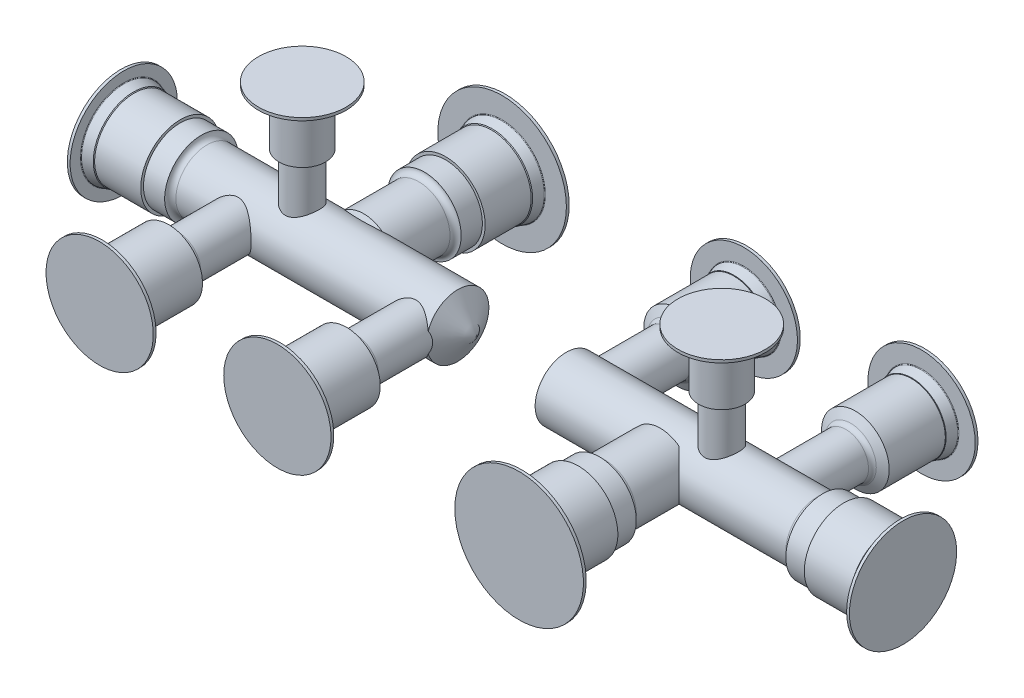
from build123d import *

# Parameters (mm, degrees)
LPATTERN1_COUNT       = 2
LPATTERN1_PITCH       = 50
BODY_MOVE_COPY1_ANGLE = 180
LPATTERN2_COUNT       = 2
LPATTERN2_PITCH       = 118


with BuildPart() as part:
    # Sketch1 → Revolve1 (revolve)
    with BuildSketch(Plane(origin=(0, 0, 0), x_dir=(1, 0, 0), z_dir=(0, 1, 0)), mode=Mode.PRIVATE) as revolve1_sk:
        with BuildLine():
            Line((100, 0), (94.734658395, -8.763))
            Line((94.734658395, -8.763), (24.2062, -8.763))
            ThreePointArc((24.2062, -8.763), (23.092648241, -9.224248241), (22.6314, -10.3378))
            Line((22.6314, -10.3378), (16.6624, -10.3378))
            Line((16.6624, -10.3378), (16.6624, -11.1125))
            Line((16.6624, -11.1125), (3.713097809, -11.1125))
            Line((3.713097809, -11.1125), (3.5179, -11.307697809))
            Line((3.5179, -11.307697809), (0.928594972, -12.0015))
            ThreePointArc((0.928594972, -12.0015), (0.826766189, -12.069539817), (0.7874, -12.185508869))
            Line((0.7874, -12.185508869), (0.7874, -15.0876))
            Line((0.7874, -15.0876), (0, -15.0876))
            Line((0, -15.0876), (0, 0))
            Line((0, 0), (100, 0))
        make_face()
    revolve(revolve1_sk.sketch.rotate(Axis((100, 0, 0), (-1, 0, 0)), 180), axis=Axis((100, 0, 0), (-1, 0, 0)))

    # Sketch2 → Revolve2 (revolve)
    with BuildSketch(Plane(origin=(0, 0, 0), x_dir=(1, 0, 0), z_dir=(0, 1, 0)), mode=Mode.PRIVATE) as revolve2_sk:
        with BuildLine():
            Line((54.0876, -44.2126), (54.0876, -45))
            Line((54.0876, -45), (39, -45))
            Line((39, -45), (39, 0))
            Line((39, 0), (45.3754, -3.830726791))
            Line((45.3754, -3.830726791), (45.3754, -22.911503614))
            ThreePointArc((45.3754, -22.911503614), (45.593306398, -23.710775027), (46.186721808, -24.288854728))
            Line((46.186721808, -24.288854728), (48.525, -25.584983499))
            Line((48.525, -25.584983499), (48.525, -41.375802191))
            Line((48.525, -41.375802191), (48.631297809, -41.4821))
            Line((48.631297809, -41.4821), (49.3251, -44.071405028))
            ThreePointArc((49.3251, -44.071405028), (49.393139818, -44.173233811), (49.50910887, -44.2126))
            Line((49.50910887, -44.2126), (54.0876, -44.2126))
        make_face()
    revolve2 = revolve(revolve2_sk.sketch.rotate(Axis((39, 0, 0), (0, 0, 1)), 180), axis=Axis((39, 0, 0), (0, 0, 1)))

    # LPattern1: Revolve2 ×2
    with Locations(*[(i * LPATTERN1_PITCH, 0, 0) for i in range(1, LPATTERN1_COUNT)]):
        add(revolve2)

    # Sketch3 → Revolve3 (revolve)
    with BuildSketch(Plane(origin=(0, 0, 0), x_dir=(1, 0, 0), z_dir=(0, 1, 0)), mode=Mode.PRIVATE) as revolve3_sk:
        with BuildLine():
            Line((63, 0), (54.237, 5.265341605))
            Line((54.237, 5.265341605), (54.237, 20.7938))
            ThreePointArc((54.237, 20.7938), (53.775751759, 21.907351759), (52.6622, 22.3686))
            Line((52.6622, 22.3686), (52.6622, 28.3376))
            Line((52.6622, 28.3376), (51.8875, 28.3376))
            Line((51.8875, 28.3376), (51.8875, 41.286902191))
            Line((51.8875, 41.286902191), (51.692302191, 41.4821))
            Line((51.692302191, 41.4821), (50.9985, 44.071405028))
            ThreePointArc((50.9985, 44.071405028), (50.930460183, 44.173233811), (50.814491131, 44.2126))
            Line((50.814491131, 44.2126), (44.91, 44.2126))
            Line((44.91, 44.2126), (44.91, 45))
            Line((44.91, 45), (63, 45))
            Line((63, 45), (63, 0))
        make_face()
    revolve(revolve3_sk.sketch.rotate(Axis((63, 0, 0), (0, 0, -1)), 180), axis=Axis((63, 0, 0), (0, 0, -1)))


with BuildPart() as body_2:
    # Mirror2: mirrored copy
    add(part.part.mirror(Plane(origin=(110, 0, 0), x_dir=(0, 0, 1), z_dir=(1, 0, 0))))


with BuildPart() as body_2_1:
    # Body-Move_Copy1: moved
    add(body_2.part.rotate(Axis((0, 0, 0), (1, 0, 0)), BODY_MOVE_COPY1_ANGLE))


with BuildPart() as part_1:
    add(part.part)

    # Sketch4 → Revolve4 (revolve)
    with BuildSketch(Plane.XY):
        Polygon((51, 0), (55.7625, 2.861598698), (55.7625, 21.2414), (57.5405, 21.2414), (57.5405, 33.305438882), (58.290761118, 34.0557), (58.85495, 36.71), (63.319, 36.71), (63.319, 37.5), (51, 37.5), align=None)
    revolve4 = revolve(axis=Axis((51, 0, 0), (0, 1, 0)))


with BuildPart() as body_2_2:
    add(body_2_1.part)

    # LPattern2: Revolve4 ×2
    with Locations(*[(i * LPATTERN2_PITCH, 0, 0) for i in range(1, LPATTERN2_COUNT)]):
        add(revolve4)


solid = Compound([part_1.part, body_2_2.part])
